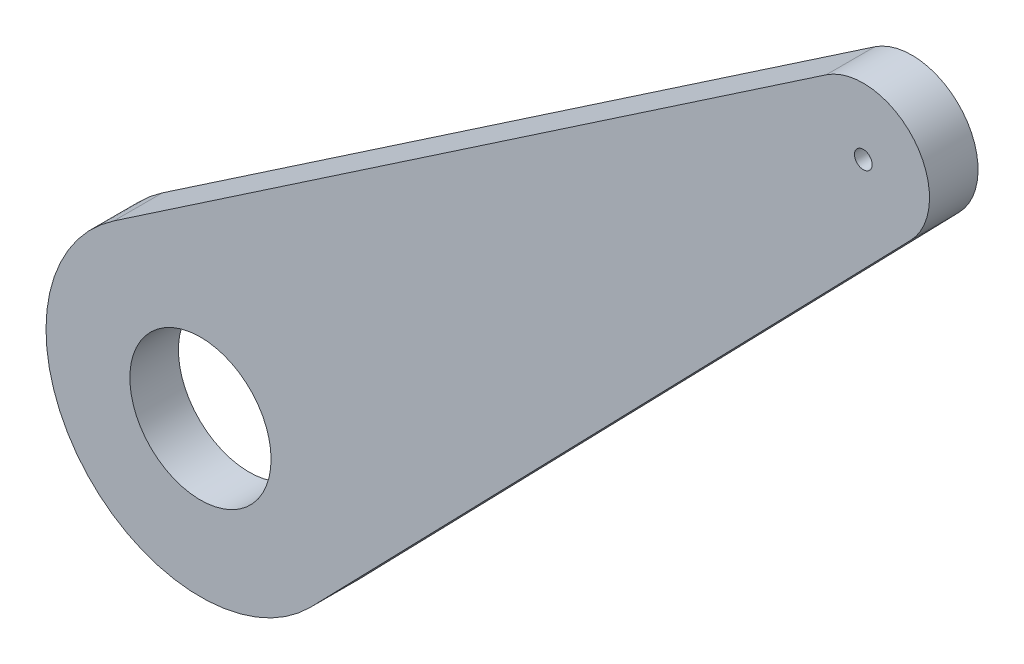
from build123d import *

# Parameters (mm, degrees)
ESQUISSE1_R        = 17.5
ESQUISSE1_R_2      = 8
ESQUISSE1_R_3      = 7.5
ESQUISSE1_R_4      = 1
BOSS_EXTRU_1_DEPTH = 5.5


with BuildPart() as part:
    # Esquisse1 → Boss.-Extru.1 (new body)
    # profile 1 of 3: a face of its own
    with BuildSketch(Plane.XY):
        with BuildLine():
            Line((12.553348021, -12.19276234), (80.476412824, 57.739042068))
            ThreePointArc((80.476412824, 57.739042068), (69.34923256, 58.145799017), (70.889292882, 69.173391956))
            Line((70.889292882, 69.173391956), (-9.816598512, 14.487387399))
            ThreePointArc((-9.816598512, 14.487387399), (8.19937577, 15.460279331), (17.5, 0))
            ThreePointArc((17.5, 0), (16.21625096, -6.57899725), (12.553348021, -12.19276234))
        make_face()
    # profile 2 of 3: a face of its own
    with BuildSketch(Plane.XY):
        Circle(ESQUISSE1_R)
        Circle(ESQUISSE1_R_2, mode=Mode.SUBTRACT)
    # profile 3 of 3: a face of its own
    with BuildSketch(Plane.XY):
        with Locations((75.09640653, 62.964511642)):
            Circle(ESQUISSE1_R_3)
        with Locations((75.09640653, 62.964511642)):
            Circle(ESQUISSE1_R_4, mode=Mode.SUBTRACT)
    extrude(amount=BOSS_EXTRU_1_DEPTH)


solid = part.part
